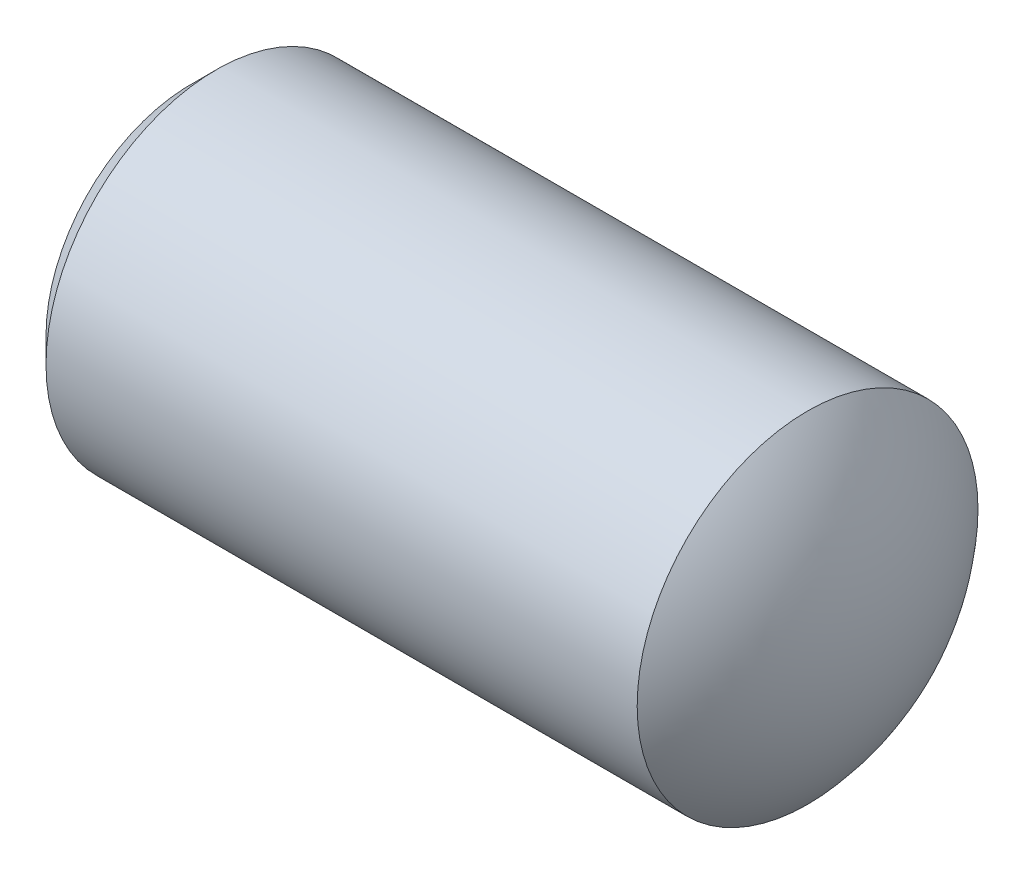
from build123d import *

# Parameters (mm, degrees)
HEX_2_DEPTH = 14.2748


with BuildPart() as part:
    # BodySke → BaseBody (revolve)
    with BuildSketch(Plane.XY, mode=Mode.PRIVATE) as basebody_sk:
        with BuildLine():
            Line((0, 0), (0, 10.81024))
            Line((0, 10.81024), (1.88976, 12.7))
            Line((1.88976, 12.7), (45.949031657, 12.7))
            ThreePointArc((45.949031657, 12.7), (49.545983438, 6.79746081), (50.8, 0))
            Line((50.8, 0), (0, 0))
        make_face()
    revolve(basebody_sk.sketch.rotate(Axis((-12.7, 0, 0), (1, 0, 0)), 90), axis=Axis((-12.7, 0, 0), (1, 0, 0)))

    # Sketch2 → Hex 2 (cut)
    with BuildSketch(Plane.ZY):
        Polygon((4.120779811, 7.1374), (-4.120779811, 7.1374), (-8.241559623, 0), (-4.120779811, -7.1374), (4.120779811, -7.1374), (8.241559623, 0), align=None)
    extrude(amount=-HEX_2_DEPTH, mode=Mode.SUBTRACT)


solid = part.part
